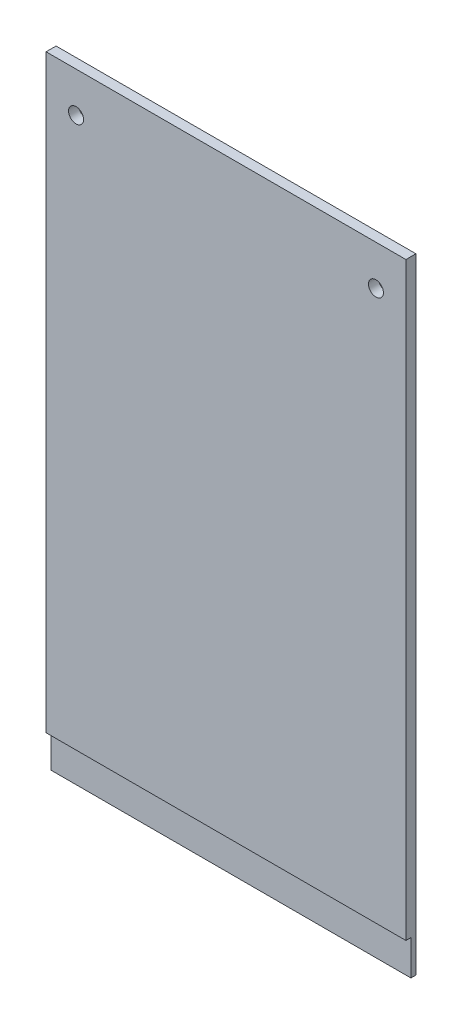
from build123d import *

# Parameters (mm, degrees)
SKETCH2_W           = 72
SKETCH2_H           = 244
BOSS_EXTRUDE1_DEPTH = 2
SKETCH3_R           = 1.5
CUT_EXTRUDE1_DEPTH  = 128.21635115
SKETCH5_W           = 72
SKETCH5_H           = 119
CUT_EXTRUDE2_DEPTH  = 128.21635115
SKETCH4_W           = 1
SKETCH4_H           = 7
CUT_EXTRUDE3_DEPTH  = 142.675685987


with BuildPart() as part:
    # Sketch2 → Boss-Extrude1 (new body)
    with BuildSketch(Plane.XY):
        Rectangle(SKETCH2_W, SKETCH2_H)
    extrude(amount=BOSS_EXTRUDE1_DEPTH)

    # Sketch3 → Cut-Extrude1 (cut, through all)
    with BuildSketch(Plane.XY.offset(2)):
        with Locations((30, 114)):
            Circle(SKETCH3_R)
        with Locations((-30, 114)):
            Circle(SKETCH3_R)
        with Locations((30, -114)):
            Circle(SKETCH3_R)
        with Locations((-30, -114)):
            Circle(SKETCH3_R)
    extrude(amount=-CUT_EXTRUDE1_DEPTH, mode=Mode.SUBTRACT)

    # Sketch5 → Cut-Extrude2 (cut, through all)
    with BuildSketch(Plane.XY.offset(2)):
        with Locations((0, -62.5)):
            Rectangle(SKETCH5_W, SKETCH5_H)
    extrude(amount=-CUT_EXTRUDE2_DEPTH, mode=Mode.SUBTRACT)

    # Sketch4 → Cut-Extrude3 (cut, through all)
    with BuildSketch(Plane(origin=(36, 0, 0), x_dir=(0, 0, -1), z_dir=(1, 0, 0))):
        with Locations((-1.5, 0.5)):
            Rectangle(SKETCH4_W, SKETCH4_H)
    extrude(amount=-CUT_EXTRUDE3_DEPTH, mode=Mode.SUBTRACT)


solid = part.part
